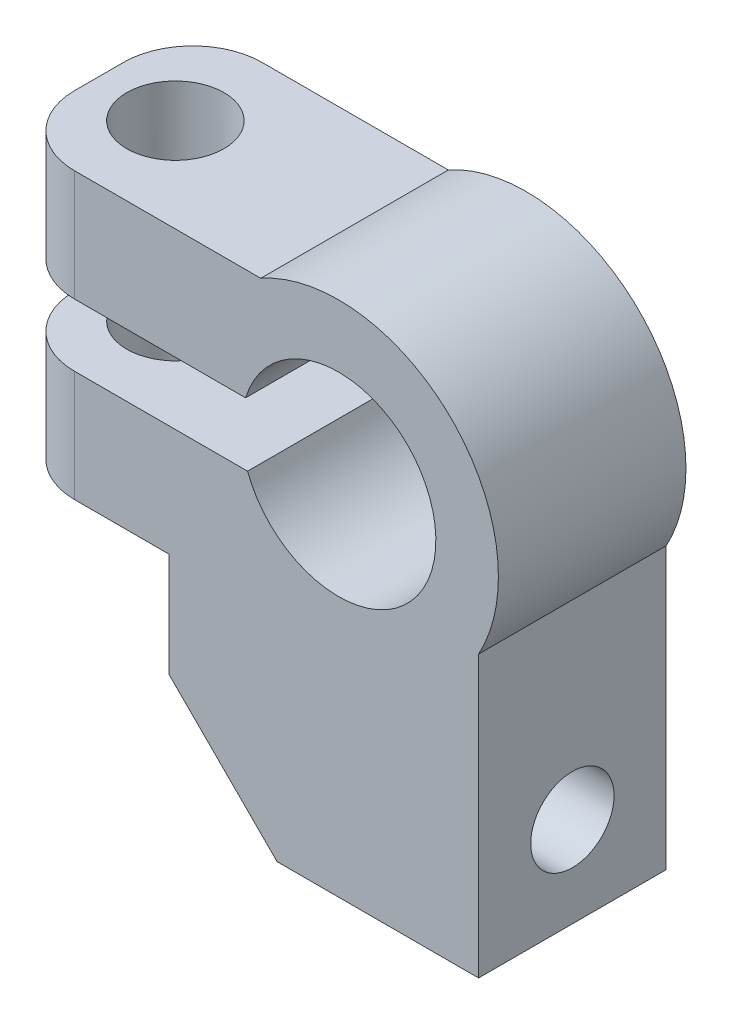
from build123d import *

# Parameters (mm, degrees)
BASE_EXTRUSION_DEPTH       = 27
ESQUISSE2_R                = 7
ENL_V_MAT_EXTRU_1_DEPTH    = 71.438330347
D_GAGEMENT_POUR_M201_D     = 12
D_GAGEMENT_POUR_M201_DEPTH = 30
D_GAGEMENT_POUR_M201_TIP   = 3.605163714
CONG_1_R                   = 10


with BuildPart() as part:
    # Esquisse1 → Base-Extrusion (new body)
    with BuildSketch(Plane.XY):
        with BuildLine():
            Line((-11.207453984, 20.084645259), (-48, 20.084645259))
            Line((-48, 20.084645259), (-48, 4.084645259))
            Line((-48, 4.084645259), (-13.390880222, 4.084645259))
            ThreePointArc((-13.390880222, 4.084645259), (13.993126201, 0.438656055), (-13.10874852, -4.915354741))
            Line((-13.10874852, -4.915354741), (-48, -4.915354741))
            Line((-48, -4.915354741), (-48, -20.915354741))
            Line((-48, -20.915354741), (-24.405901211, -20.915354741))
            Line((-24.405901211, -20.915354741), (-24.405901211, -35.915354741))
            Line((-24.405901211, -35.915354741), (-8.849552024, -51.471703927))
            Line((-8.849552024, -51.471703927), (20.150447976, -51.471703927))
            Line((20.150447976, -51.471703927), (20.150447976, -11.088708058))
            ThreePointArc((20.150447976, -11.088708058), (16.215386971, 16.311383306), (-11.207453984, 20.084645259))
        make_face()
    extrude(amount=BASE_EXTRUSION_DEPTH)

    # Esquisse2 → Enl_v. mat.-Extru.1 (cut, through all)
    with BuildSketch(Plane.XZ.offset(20.915354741)):
        with Locations(Location((-37, 13.5, 0), (0, 0, 270))):
            Circle(ESQUISSE2_R)
    extrude(amount=-ENL_V_MAT_EXTRU_1_DEPTH, mode=Mode.SUBTRACT)

    # D_gagement pour M201
    with Locations(Plane(origin=(20.150447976, -38.471703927, 13.5), x_dir=(0, 1, 0), z_dir=(1, 0, 0))):
        with Locations((0, 0)):
            Hole(D_GAGEMENT_POUR_M201_D / 2, depth=D_GAGEMENT_POUR_M201_DEPTH)
            with Locations((0, 0, -(D_GAGEMENT_POUR_M201_DEPTH + D_GAGEMENT_POUR_M201_TIP / 2))):  # 118° drill point
                Cone(0, D_GAGEMENT_POUR_M201_D / 2, D_GAGEMENT_POUR_M201_TIP, mode=Mode.SUBTRACT)

    # Cong_1
    cong_1_edges = [part.edges().sort_by_distance(p)[0] for p in [
        (-48, 12.084645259, 0),
        (-48, -12.915354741, 0),
        (-48, 12.084645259, 27),
        (-48, -12.915354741, 27),
    ]]
    fillet(cong_1_edges, radius=CONG_1_R)


solid = part.part
